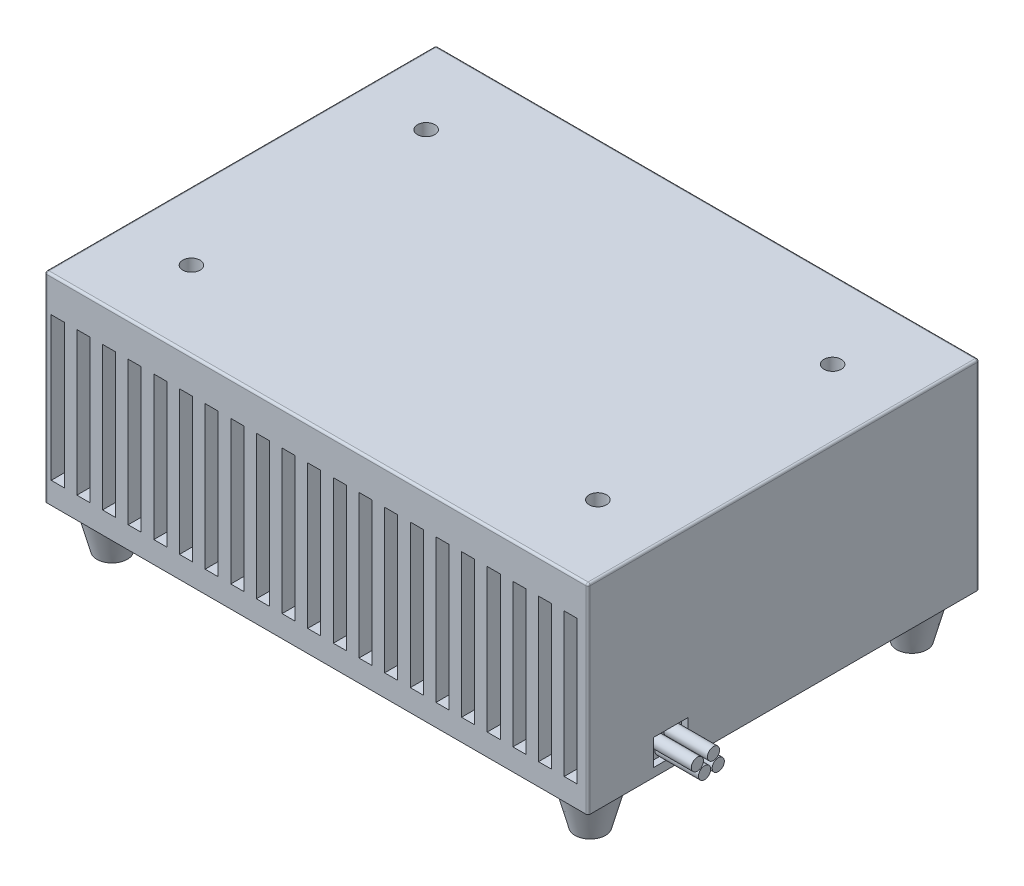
from build123d import *

# Parameters (mm, degrees)
SKETCH1_W           = 125
SKETCH1_H           = 90
BOSS_EXTRUDE1_DEPTH = 56
SKETCH2_W           = 3
SKETCH2_H           = 33
CUT_EXTRUDE1_DEPTH  = 56
FILLET1_R           = 0.5
SKETCH3_W           = 165.560165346
SKETCH3_H           = 129.977436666
SKETCH3_R           = 3.5
CUT_EXTRUDE2_DEPTH  = 10
CUT_EXTRUDE2_DRAFT  = -15
SKETCH4_W           = 8
SKETCH4_H           = 6
CUT_EXTRUDE3_DEPTH  = 1.5
SKETCH5_R           = 1.4
BOSS_EXTRUDE2_DEPTH = 10
SKETCH6_R           = 2
CUT_EXTRUDE6_DEPTH  = 8


with BuildPart() as part:
    # Sketch1 → Boss-Extrude1 (new body)
    with BuildSketch(Plane(origin=(0, 0, 0), x_dir=(1, 0, 0), z_dir=(0, 1, 0))):
        Rectangle(SKETCH1_W, SKETCH1_H)
    extrude(amount=BOSS_EXTRUDE1_DEPTH)

    # Sketch2 → Cut-Extrude1 (cut)
    with BuildSketch(Plane.XY.offset(45)):
        with Locations((-59.5, 31.5)):
            Rectangle(SKETCH2_W, SKETCH2_H)
        with Locations((-53.6, 31.5)):
            Rectangle(SKETCH2_W, SKETCH2_H)
        with Locations((-47.7, 31.5)):
            Rectangle(SKETCH2_W, SKETCH2_H)
        with Locations((-41.8, 31.5)):
            Rectangle(SKETCH2_W, SKETCH2_H)
        with Locations((-35.9, 31.5)):
            Rectangle(SKETCH2_W, SKETCH2_H)
        with Locations((-30, 31.5)):
            Rectangle(SKETCH2_W, SKETCH2_H)
        with Locations((-24.1, 31.5)):
            Rectangle(SKETCH2_W, SKETCH2_H)
        with Locations((-18.2, 31.5)):
            Rectangle(SKETCH2_W, SKETCH2_H)
        with Locations((-12.3, 31.5)):
            Rectangle(SKETCH2_W, SKETCH2_H)
        with Locations((-6.4, 31.5)):
            Rectangle(SKETCH2_W, SKETCH2_H)
        with Locations((-0.5, 31.5)):
            Rectangle(SKETCH2_W, SKETCH2_H)
        with Locations((5.4, 31.5)):
            Rectangle(SKETCH2_W, SKETCH2_H)
        with Locations((11.3, 31.5)):
            Rectangle(SKETCH2_W, SKETCH2_H)
        with Locations((17.2, 31.5)):
            Rectangle(SKETCH2_W, SKETCH2_H)
        with Locations((23.1, 31.5)):
            Rectangle(SKETCH2_W, SKETCH2_H)
        with Locations((29, 31.5)):
            Rectangle(SKETCH2_W, SKETCH2_H)
        with Locations((34.9, 31.5)):
            Rectangle(SKETCH2_W, SKETCH2_H)
        with Locations((40.8, 31.5)):
            Rectangle(SKETCH2_W, SKETCH2_H)
        with Locations((46.7, 31.5)):
            Rectangle(SKETCH2_W, SKETCH2_H)
        with Locations((52.6, 31.5)):
            Rectangle(SKETCH2_W, SKETCH2_H)
        with Locations((58.5, 31.5)):
            Rectangle(SKETCH2_W, SKETCH2_H)
    extrude(amount=-CUT_EXTRUDE1_DEPTH, mode=Mode.SUBTRACT)

    # Fillet1
    fillet1_edges = [part.edges().sort_by_distance(p)[0] for p in [
        (-62.5, 56, 0),
        (0, 56, 45),
        (62.5, 56, 0),
        (-62.5, 0, 0),
        (0, 0, -45),
        (62.5, 0, 0),
        (62.5, 28, 45),
        (-62.5, 28, 45),
        (-62.5, 28, -45),
        (62.5, 28, -45),
        (0, 56, -45),
    ]]
    fillet(fillet1_edges, radius=FILLET1_R)


with BuildPart() as cut_extrude2_tool:
    # Sketch3 → Cut-Extrude2 (with draft: the straight prism first)
    with BuildSketch(Plane.XZ):
        Rectangle(SKETCH3_W, SKETCH3_H)
        with Locations((-55, 37)):
            Circle(SKETCH3_R, mode=Mode.SUBTRACT)
        with Locations((55, 37)):
            Circle(SKETCH3_R, mode=Mode.SUBTRACT)
        with Locations((55, -37)):
            Circle(SKETCH3_R, mode=Mode.SUBTRACT)
        with Locations((-55, -37)):
            Circle(SKETCH3_R, mode=Mode.SUBTRACT)
    extrude(amount=-CUT_EXTRUDE2_DEPTH)
    # Cut-Extrude2: the draft: its side faces are tilted about the plane it starts from
    cut_extrude2_sides = [cut_extrude2_tool.faces().sort_by_distance(p)[0] for p in [
        (0, 5, -64.988718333),
        (82.780082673, 5, 0),
        (0, 5, 64.988718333),
        (-82.780082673, 5, 0),
        (-58.5, 5, 37),
        (51.5, 5, 37),
        (51.5, 5, -37),
        (-58.5, 5, -37),
    ]]
    draft(cut_extrude2_sides, Plane.XZ, CUT_EXTRUDE2_DRAFT)


with BuildPart() as part_1:
    add(part.part)

    # Cut-Extrude2: cut by cut_extrude2_tool
    add(cut_extrude2_tool.part, mode=Mode.SUBTRACT)

    # Sketch4 → Cut-Extrude3 (cut)
    with BuildSketch(Plane(origin=(62.5, 0, 0), x_dir=(0, 0, -1), z_dir=(1, 0, 0))):
        with Locations((-26, 15)):
            Rectangle(SKETCH4_W, SKETCH4_H)
    extrude(amount=-CUT_EXTRUDE3_DEPTH, mode=Mode.SUBTRACT)

    # Sketch5 → Boss-Extrude2 (add)
    with BuildSketch(Plane(origin=(61, 0, 0), x_dir=(0, 0, -1), z_dir=(1, 0, 0))):
        with Locations(Location((-28.358400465, 16.130374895, 0), (0, 0, 180))):
            Circle(SKETCH5_R)
        with Locations(Location((-24.638949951, 16.397517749, 0), (0, 0, 180))):
            Circle(SKETCH5_R)
        with Locations(Location((-23.549829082, 13.623341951, 0), (0, 0, 180))):
            Circle(SKETCH5_R)
        with Locations(Location((-26.693894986, 13.602792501, 0), (0, 0, 180))):
            Circle(SKETCH5_R)
    extrude(amount=BOSS_EXTRUDE2_DEPTH)

    # Sketch6 → Cut-Extrude6 (cut)
    with BuildSketch(Plane(origin=(0, 56, 0), x_dir=(1, 0, 0), z_dir=(0, 1, 0))):
        with Locations(Location((-46.75, 27, 0), (0, 0, 270))):
            Circle(SKETCH6_R)
        with Locations(Location((46.75, 27, 0), (0, 0, 270))):
            Circle(SKETCH6_R)
        with Locations(Location((46.75, -27, 0), (0, 0, 270))):
            Circle(SKETCH6_R)
        with Locations(Location((-46.75, -27, 0), (0, 0, 270))):
            Circle(SKETCH6_R)
    extrude(amount=-CUT_EXTRUDE6_DEPTH, mode=Mode.SUBTRACT)


solid = part_1.part
